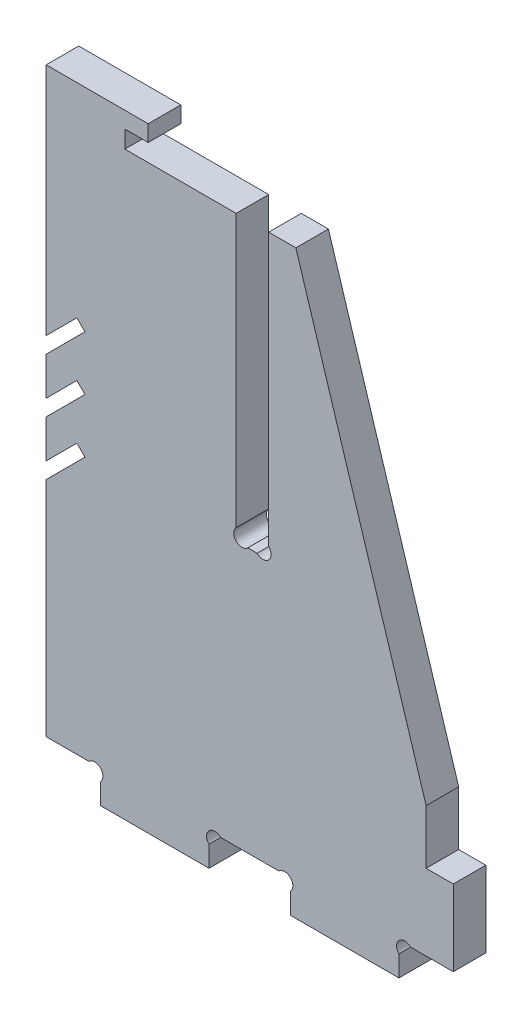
from build123d import *

# Parameters (mm, degrees)
EXTRUSION1_DEPTH = 6


with BuildPart() as part:
    # Esquisse1 → Extrusion1 (new body)
    with BuildSketch(Plane.XY):
        with BuildLine():
            Line((10, 3.850395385), (10, 0))
            Line((10, 0), (30, 0))
            Line((30, 0), (30, 3.850395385))
            ThreePointArc((30, 3.850395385), (30, 6), (32.149604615, 6))
            Line((32.149604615, 6), (42.850395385, 6))
            ThreePointArc((42.850395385, 6), (45, 6), (45, 3.850395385))
            Line((45, 3.850395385), (45, 0))
            Line((45, 0), (65, 0))
            Line((65, 0), (65, 3.850395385))
            ThreePointArc((65, 3.850395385), (65, 6), (67.149604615, 6))
            Line((67.149604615, 6), (75, 6))
            Line((75, 6), (75, 20))
            Line((75, 20), (70, 20))
            Line((70, 20), (70, 30))
            Line((70, 30), (46, 107))
            Line((46, 107), (41, 107))
            Line((41, 107), (41, 56.849604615))
            ThreePointArc((41, 56.849604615), (41, 54.7), (38.850395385, 54.7))
            Line((38.850395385, 54.7), (37.149604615, 54.7))
            ThreePointArc((37.149604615, 54.7), (35, 54.7), (35, 56.849604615))
            Line((35, 56.849604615), (35, 107))
            Line((35, 107), (14.5, 107))
            Line((14.5, 107), (14.5, 110.2))
            Line((14.5, 110.2), (18.8, 110.2))
            Line((18.8, 110.2), (18.8, 113.2))
            Line((18.8, 113.2), (0, 113.2))
            Line((0, 113.2), (0, 70))
            Line((0, 70), (5.656854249, 75.656854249))
            Line((5.656854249, 75.656854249), (7.14177849, 74.171930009))
            Line((7.14177849, 74.171930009), (0, 67.030151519))
            Line((0, 67.030151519), (0, 60))
            Line((0, 60), (5.656854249, 65.656854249))
            Line((5.656854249, 65.656854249), (7.14177849, 64.171930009))
            Line((7.14177849, 64.171930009), (0, 57.030151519))
            Line((0, 57.030151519), (0, 50))
            Line((0, 50), (5.656854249, 55.656854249))
            Line((5.656854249, 55.656854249), (7.14177849, 54.171930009))
            Line((7.14177849, 54.171930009), (0, 47.030151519))
            Line((0, 47.030151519), (0, 6))
            Line((0, 6), (7.850395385, 6))
            ThreePointArc((7.850395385, 6), (10, 6), (10, 3.850395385))
        make_face()
    extrude(amount=EXTRUSION1_DEPTH)


solid = part.part
